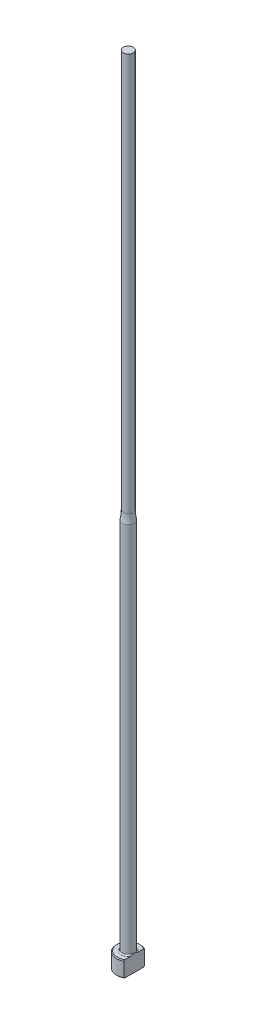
ISO-10303-21;
HEADER;
FILE_DESCRIPTION(('STEP AP214'),'2;1');
FILE_NAME('part.step','',(''),(''),'','','');
FILE_SCHEMA(('AUTOMOTIVE_DESIGN { 1 0 10303 214 1 1 1 1 }'));
ENDSEC;
DATA;
#1=APPLICATION_CONTEXT('core data for automotive mechanical design processes');
#2=APPLICATION_PROTOCOL_DEFINITION('international standard','automotive_design',2000,#1);
#3=PRODUCT_CONTEXT('',#1,'mechanical');
#4=PRODUCT('Part','Part','',(#3));
#5=PRODUCT_RELATED_PRODUCT_CATEGORY('part','',(#4));
#6=PRODUCT_DEFINITION_FORMATION('','',#4);
#7=PRODUCT_DEFINITION_CONTEXT('part definition',#1,'design');
#8=PRODUCT_DEFINITION('design','',#6,#7);
#9=PRODUCT_DEFINITION_SHAPE('','',#8);
#10=(LENGTH_UNIT() NAMED_UNIT(*) SI_UNIT(.MILLI.,.METRE.));
#11=(NAMED_UNIT(*) PLANE_ANGLE_UNIT() SI_UNIT($,.RADIAN.));
#12=(NAMED_UNIT(*) SI_UNIT($,.STERADIAN.) SOLID_ANGLE_UNIT());
#13=UNCERTAINTY_MEASURE_WITH_UNIT(LENGTH_MEASURE(1.E-05),#10,'distance_accuracy_value','');
#14=(GEOMETRIC_REPRESENTATION_CONTEXT(3) GLOBAL_UNCERTAINTY_ASSIGNED_CONTEXT((#13)) GLOBAL_UNIT_ASSIGNED_CONTEXT((#10,
#11,#12)) REPRESENTATION_CONTEXT('',''));
#15=CARTESIAN_POINT('',(0.,0.,0.));
#16=DIRECTION('',(0.,0.,1.));
#17=DIRECTION('',(1.,0.,0.));
#18=AXIS2_PLACEMENT_3D('',#15,#16,#17);
#19=CARTESIAN_POINT('',(-2.99999999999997,4.,0.));
#20=DIRECTION('',(0.,1.,0.));
#21=DIRECTION('',(0.,0.,1.));
#22=AXIS2_PLACEMENT_3D('',#19,#20,#21);
#23=PLANE('',#22);
#24=CARTESIAN_POINT('',(0.,4.,0.));
#25=DIRECTION('',(0.,1.,0.));
#26=DIRECTION('',(0.,0.,1.));
#27=AXIS2_PLACEMENT_3D('',#24,#25,#26);
#28=CIRCLE('',#27,2.79999999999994);
#29=CARTESIAN_POINT('',(1.49999999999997,4.,-2.36431808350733));
#30=VERTEX_POINT('',#29);
#31=CARTESIAN_POINT('',(1.49999999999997,4.,2.36431808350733));
#32=VERTEX_POINT('',#31);
#33=EDGE_CURVE('E187',#30,#32,#28,.T.);
#34=ORIENTED_EDGE('',*,*,#33,.T.);
#35=DIRECTION('',(0.,0.,-1.));
#36=VECTOR('',#35,1.);
#37=CARTESIAN_POINT('',(1.49999999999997,4.,0.));
#38=LINE('',#37,#36);
#39=CARTESIAN_POINT('',(1.49999999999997,4.00000000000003,0.994987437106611));
#40=VERTEX_POINT('',#39);
#41=EDGE_CURVE('E57',#32,#40,#38,.T.);
#42=ORIENTED_EDGE('',*,*,#41,.T.);
#43=CARTESIAN_POINT('',(0.,4.,0.));
#44=DIRECTION('',(0.,1.,0.));
#45=DIRECTION('',(0.,0.,1.));
#46=AXIS2_PLACEMENT_3D('',#43,#44,#45);
#47=CIRCLE('',#46,1.79999999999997);
#48=CARTESIAN_POINT('',(1.49999999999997,4.00000000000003,-0.994987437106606));
#49=VERTEX_POINT('',#48);
#50=EDGE_CURVE('E108',#40,#49,#47,.F.);
#51=ORIENTED_EDGE('',*,*,#50,.T.);
#52=EDGE_CURVE('E137',#49,#30,#38,.T.);
#53=ORIENTED_EDGE('',*,*,#52,.T.);
#54=EDGE_LOOP('',(#34,#42,#51,#53));
#55=FACE_BOUND('',#54,.T.);
#56=ADVANCED_FACE('F32',(#55),#23,.T.);
#57=CARTESIAN_POINT('',(0.,259.958771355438,0.));
#58=DIRECTION('',(0.,1.,0.));
#59=DIRECTION('',(0.,0.,1.));
#60=AXIS2_PLACEMENT_3D('',#57,#58,#59);
#61=CYLINDRICAL_SURFACE('',#60,2.99999999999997);
#62=CARTESIAN_POINT('',(0.,3.79999999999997,0.));
#63=DIRECTION('',(0.,1.,0.));
#64=DIRECTION('',(0.,0.,1.));
#65=AXIS2_PLACEMENT_3D('',#62,#63,#64);
#66=CIRCLE('',#65,2.99999999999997);
#67=CARTESIAN_POINT('',(1.49999999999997,3.79999999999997,2.5980762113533));
#68=VERTEX_POINT('',#67);
#69=CARTESIAN_POINT('',(1.49999999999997,3.79999999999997,-2.5980762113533));
#70=VERTEX_POINT('',#69);
#71=EDGE_CURVE('E105',#68,#70,#66,.F.);
#72=ORIENTED_EDGE('',*,*,#71,.T.);
#73=DIRECTION('',(0.,-1.,0.));
#74=VECTOR('',#73,1.);
#75=CARTESIAN_POINT('',(1.49999999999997,200.,-2.5980762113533));
#76=LINE('',#75,#74);
#77=CARTESIAN_POINT('',(1.49999999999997,0.200000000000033,-2.5980762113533));
#78=VERTEX_POINT('',#77);
#79=EDGE_CURVE('E193',#70,#78,#76,.T.);
#80=ORIENTED_EDGE('',*,*,#79,.T.);
#81=CARTESIAN_POINT('',(0.,0.200000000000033,0.));
#82=DIRECTION('',(0.,-1.,0.));
#83=DIRECTION('',(0.,0.,-1.));
#84=AXIS2_PLACEMENT_3D('',#81,#82,#83);
#85=CIRCLE('',#84,2.99999999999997);
#86=CARTESIAN_POINT('',(1.49999999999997,0.200000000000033,2.5980762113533));
#87=VERTEX_POINT('',#86);
#88=EDGE_CURVE('E100',#78,#87,#85,.F.);
#89=ORIENTED_EDGE('',*,*,#88,.T.);
#90=DIRECTION('',(0.,-1.,0.));
#91=VECTOR('',#90,1.);
#92=CARTESIAN_POINT('',(1.49999999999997,200.,2.5980762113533));
#93=LINE('',#92,#91);
#94=EDGE_CURVE('E93',#68,#87,#93,.T.);
#95=ORIENTED_EDGE('',*,*,#94,.F.);
#96=EDGE_LOOP('',(#72,#80,#89,#95));
#97=FACE_BOUND('',#96,.T.);
#98=ADVANCED_FACE('F158',(#97),#61,.T.);
#99=CARTESIAN_POINT('',(0.,0.,0.));
#100=DIRECTION('',(0.,-1.,0.));
#101=DIRECTION('',(0.,0.,-1.));
#102=AXIS2_PLACEMENT_3D('',#99,#100,#101);
#103=PLANE('',#102);
#104=CARTESIAN_POINT('',(0.,0.,0.));
#105=DIRECTION('',(0.,-1.,0.));
#106=DIRECTION('',(0.,0.,-1.));
#107=AXIS2_PLACEMENT_3D('',#104,#105,#106);
#108=CIRCLE('',#107,2.79999999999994);
#109=CARTESIAN_POINT('',(1.49999999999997,0.,2.36431808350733));
#110=VERTEX_POINT('',#109);
#111=CARTESIAN_POINT('',(1.49999999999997,0.,-2.36431808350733));
#112=VERTEX_POINT('',#111);
#113=EDGE_CURVE('E98',#110,#112,#108,.T.);
#114=ORIENTED_EDGE('',*,*,#113,.T.);
#115=DIRECTION('',(0.,0.,1.));
#116=VECTOR('',#115,1.);
#117=CARTESIAN_POINT('',(1.49999999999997,0.,2.5980762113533));
#118=LINE('',#117,#116);
#119=EDGE_CURVE('E83',#112,#110,#118,.T.);
#120=ORIENTED_EDGE('',*,*,#119,.T.);
#121=EDGE_LOOP('',(#114,#120));
#122=FACE_BOUND('',#121,.T.);
#123=ADVANCED_FACE('F103',(#122),#103,.T.);
#124=CARTESIAN_POINT('',(0.,4.,0.));
#125=DIRECTION('',(0.,-1.,0.));
#126=DIRECTION('',(0.,0.,-1.));
#127=AXIS2_PLACEMENT_3D('',#124,#125,#126);
#128=CONICAL_SURFACE('',#127,2.79999999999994,0.785398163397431);
#129=ORIENTED_EDGE('',*,*,#71,.F.);
#130=CARTESIAN_POINT('',(1.49999999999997,0.888258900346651,5.71827621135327));
#131=CARTESIAN_POINT('',(1.49999999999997,1.01361833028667,5.58866816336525));
#132=CARTESIAN_POINT('',(1.49999999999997,1.13884324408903,5.45892957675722));
#133=CARTESIAN_POINT('',(1.49999999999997,1.38894444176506,5.19911365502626));
#134=CARTESIAN_POINT('',(1.49999999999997,1.51382072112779,5.06903631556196));
#135=CARTESIAN_POINT('',(1.49999999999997,1.76320568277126,4.80840180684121));
#136=CARTESIAN_POINT('',(1.49999999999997,1.88771414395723,4.67784442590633));
#137=CARTESIAN_POINT('',(1.49999999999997,2.13618059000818,4.4162081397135));
#138=CARTESIAN_POINT('',(1.49999999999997,2.26013857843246,4.28512923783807));
#139=CARTESIAN_POINT('',(1.49999999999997,2.50488975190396,4.02490837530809));
#140=CARTESIAN_POINT('',(1.49999999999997,2.62569693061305,3.8957795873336));
#141=CARTESIAN_POINT('',(1.49999999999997,2.86640694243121,3.63668213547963));
#142=CARTESIAN_POINT('',(1.49999999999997,2.98630978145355,3.50671347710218));
#143=CARTESIAN_POINT('',(1.49999999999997,3.22486033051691,3.24567921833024));
#144=CARTESIAN_POINT('',(1.49999999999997,3.3435083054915,3.11461386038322));
#145=CARTESIAN_POINT('',(1.49999999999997,3.5790771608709,2.85094268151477));
#146=CARTESIAN_POINT('',(1.49999999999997,3.69599811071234,2.71833692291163));
#147=CARTESIAN_POINT('',(1.49999999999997,3.88262371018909,2.50255231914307));
#148=CARTESIAN_POINT('',(1.49999999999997,3.95312454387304,2.42006293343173));
#149=CARTESIAN_POINT('',(1.49999999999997,4.09287098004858,2.254010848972));
#150=CARTESIAN_POINT('',(1.49999999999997,4.16211645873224,2.17044804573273));
#151=CARTESIAN_POINT('',(1.49999999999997,4.29964684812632,2.00105967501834));
#152=CARTESIAN_POINT('',(1.49999999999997,4.36791386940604,1.9152195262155));
#153=CARTESIAN_POINT('',(1.49999999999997,4.50205840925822,1.7417139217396));
#154=CARTESIAN_POINT('',(1.49999999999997,4.56793649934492,1.65404891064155));
#155=CARTESIAN_POINT('',(1.49999999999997,4.69728151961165,1.47490236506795));
#156=CARTESIAN_POINT('',(1.49999999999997,4.76069661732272,1.38338308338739));
#157=CARTESIAN_POINT('',(1.49999999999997,4.88239539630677,1.19675661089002));
#158=CARTESIAN_POINT('',(1.49999999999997,4.94067201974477,1.10164473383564));
#159=CARTESIAN_POINT('',(1.49999999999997,5.048413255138,0.908008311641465));
#160=CARTESIAN_POINT('',(1.49999999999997,5.09797809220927,0.809540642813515));
#161=CARTESIAN_POINT('',(1.49999999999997,5.18432188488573,0.607192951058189));
#162=CARTESIAN_POINT('',(1.49999999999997,5.22114374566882,0.50333247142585));
#163=CARTESIAN_POINT('',(1.49999999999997,5.26099935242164,0.347577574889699));
#164=CARTESIAN_POINT('',(1.49999999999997,5.2715702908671,0.297609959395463));
#165=CARTESIAN_POINT('',(1.49999999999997,5.28794860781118,0.196885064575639));
#166=CARTESIAN_POINT('',(1.49999999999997,5.29375640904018,0.146127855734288));
#167=CARTESIAN_POINT('',(1.49999999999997,5.30019707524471,0.0444388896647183));
#168=CARTESIAN_POINT('',(1.49999999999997,5.30084594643,-0.00649183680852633));
#169=CARTESIAN_POINT('',(1.49999999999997,5.29696416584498,-0.108155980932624));
#170=CARTESIAN_POINT('',(1.49999999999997,5.29243308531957,-0.158889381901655));
#171=CARTESIAN_POINT('',(1.49999999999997,5.27856915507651,-0.259234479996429));
#172=CARTESIAN_POINT('',(1.49999999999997,5.2692782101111,-0.308852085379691));
#173=CARTESIAN_POINT('',(1.49999999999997,5.24647108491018,-0.407110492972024));
#174=CARTESIAN_POINT('',(1.49999999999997,5.23295324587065,-0.45575090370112));
#175=CARTESIAN_POINT('',(1.49999999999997,5.20226175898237,-0.55214996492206));
#176=CARTESIAN_POINT('',(1.49999999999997,5.18506801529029,-0.599902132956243));
#177=CARTESIAN_POINT('',(1.49999999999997,5.1477138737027,-0.694205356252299));
#178=CARTESIAN_POINT('',(1.49999999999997,5.12755408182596,-0.740756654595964));
#179=CARTESIAN_POINT('',(1.49999999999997,5.0632769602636,-0.879166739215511));
#180=CARTESIAN_POINT('',(1.49999999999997,5.01551721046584,-0.969329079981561));
#181=CARTESIAN_POINT('',(1.49999999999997,4.91367909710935,-1.14604316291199));
#182=CARTESIAN_POINT('',(1.49999999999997,4.85959300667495,-1.2325903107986));
#183=CARTESIAN_POINT('',(1.49999999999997,4.74697968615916,-1.40321348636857));
#184=CARTESIAN_POINT('',(1.49999999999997,4.68843573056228,-1.4872783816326));
#185=CARTESIAN_POINT('',(1.49999999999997,4.5684384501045,-1.65322187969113));
#186=CARTESIAN_POINT('',(1.49999999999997,4.50698656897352,-1.73510153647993));
#187=CARTESIAN_POINT('',(1.49999999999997,4.3811567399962,-1.89829823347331));
#188=CARTESIAN_POINT('',(1.49999999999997,4.31675092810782,-1.97959369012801));
#189=CARTESIAN_POINT('',(1.49999999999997,4.18634068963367,-2.14090082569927));
#190=CARTESIAN_POINT('',(1.49999999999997,4.12033609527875,-2.22091236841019));
#191=CARTESIAN_POINT('',(1.49999999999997,3.92086431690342,-2.45906508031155));
#192=CARTESIAN_POINT('',(1.49999999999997,3.78562663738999,-2.61572090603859));
#193=CARTESIAN_POINT('',(1.49999999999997,3.53554498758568,-2.90006295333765));
#194=CARTESIAN_POINT('',(1.49999999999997,3.42114543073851,-3.02814382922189));
#195=CARTESIAN_POINT('',(1.49999999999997,3.1909355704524,-3.28303767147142));
#196=CARTESIAN_POINT('',(1.49999999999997,3.07512522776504,-3.40985060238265));
#197=CARTESIAN_POINT('',(1.49999999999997,2.72597067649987,-3.78913849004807));
#198=CARTESIAN_POINT('',(1.49999999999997,2.49111760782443,-4.04022177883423));
#199=CARTESIAN_POINT('',(1.49999999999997,2.0288247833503,-4.52992803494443));
#200=CARTESIAN_POINT('',(1.49999999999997,1.80147747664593,-4.7686387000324));
#201=CARTESIAN_POINT('',(1.49999999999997,1.45954865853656,-5.12558036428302));
#202=CARTESIAN_POINT('',(1.49999999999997,1.34548484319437,-5.24430773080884));
#203=CARTESIAN_POINT('',(1.49999999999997,1.11707176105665,-5.48148573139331));
#204=CARTESIAN_POINT('',(1.49999999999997,1.00272249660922,-5.59993636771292));
#205=CARTESIAN_POINT('',(1.49999999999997,0.888258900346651,-5.71827621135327));
#206=B_SPLINE_CURVE_WITH_KNOTS('',3,(#130,#131,#132,#133,#134,#135,#136,#137,#138,#139,#140,
#141,#142,#143,#144,#145,#146,#147,#148,#149,#150,#151,#152,#153,#154,#155,#156,#157,#158,#159,
#160,#161,#162,#163,#164,#165,#166,#167,#168,#169,#170,#171,#172,#173,#174,#175,#176,#177,#178,
#179,#180,#181,#182,#183,#184,#185,#186,#187,#188,#189,#190,#191,#192,#193,#194,#195,#196,#197,
#198,#199,#200,#201,#202,#203,#204,#205),.UNSPECIFIED.,.F.,.F.,(4,2,2,2,2,2,2,2,2,2,2,2,2,2,2,2,
2,2,2,2,2,2,2,2,2,2,2,2,2,2,2,2,2,2,2,2,2,4),(0.,0.540943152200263,1.08189327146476,
1.62312052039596,2.16434426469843,2.69482920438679,3.22531067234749,3.75567781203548,
4.28602356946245,4.611550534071,4.9371094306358,5.26610945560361,5.59503024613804,
5.92894782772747,6.26331713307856,6.59354403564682,6.92264800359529,7.07567478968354,
7.22868799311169,7.38122626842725,7.53377717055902,7.68500755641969,7.83629736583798,
7.988436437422,8.14054446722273,8.44618799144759,8.75220879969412,9.05944044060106,
9.36652111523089,9.6776428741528,9.98879742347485,10.609592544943,11.1247803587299,
11.6399825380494,12.6713544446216,13.6603005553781,14.1542238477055,14.6481430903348),.UNSPECIFIED.);
#207=EDGE_CURVE('E136',#68,#32,#206,.T.);
#208=ORIENTED_EDGE('',*,*,#207,.T.);
#209=ORIENTED_EDGE('',*,*,#33,.F.);
#210=EDGE_CURVE('E128',#30,#70,#206,.T.);
#211=ORIENTED_EDGE('',*,*,#210,.T.);
#212=EDGE_LOOP('',(#129,#208,#209,#211));
#213=FACE_BOUND('',#212,.T.);
#214=ADVANCED_FACE('F144',(#213),#128,.T.);
#215=CARTESIAN_POINT('',(0.,0.200000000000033,0.));
#216=DIRECTION('',(0.,1.,0.));
#217=DIRECTION('',(0.,0.,1.));
#218=AXIS2_PLACEMENT_3D('',#215,#216,#217);
#219=CONICAL_SURFACE('',#218,2.99999999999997,0.785398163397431);
#220=ORIENTED_EDGE('',*,*,#88,.F.);
#221=CARTESIAN_POINT('',(1.49999999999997,3.11174109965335,-5.71827621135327));
#222=CARTESIAN_POINT('',(1.49999999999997,2.98638166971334,-5.58866816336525));
#223=CARTESIAN_POINT('',(1.49999999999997,2.86115675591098,-5.45892957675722));
#224=CARTESIAN_POINT('',(1.49999999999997,2.61105555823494,-5.19911365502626));
#225=CARTESIAN_POINT('',(1.49999999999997,2.48617927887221,-5.06903631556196));
#226=CARTESIAN_POINT('',(1.49999999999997,2.23679431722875,-4.80840180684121));
#227=CARTESIAN_POINT('',(1.49999999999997,2.11228585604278,-4.67784442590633));
#228=CARTESIAN_POINT('',(1.49999999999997,1.86381940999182,-4.4162081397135));
#229=CARTESIAN_POINT('',(1.49999999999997,1.73986142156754,-4.28512923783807));
#230=CARTESIAN_POINT('',(1.49999999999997,1.49511024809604,-4.02490837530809));
#231=CARTESIAN_POINT('',(1.49999999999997,1.37430306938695,-3.8957795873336));
#232=CARTESIAN_POINT('',(1.49999999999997,1.13359305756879,-3.63668213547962));
#233=CARTESIAN_POINT('',(1.49999999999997,1.01369021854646,-3.50671347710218));
#234=CARTESIAN_POINT('',(1.49999999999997,0.775139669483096,-3.24567921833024));
#235=CARTESIAN_POINT('',(1.49999999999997,0.656491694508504,-3.11461386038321));
#236=CARTESIAN_POINT('',(1.49999999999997,0.420922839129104,-2.85094268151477));
#237=CARTESIAN_POINT('',(1.49999999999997,0.304001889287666,-2.71833692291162));
#238=CARTESIAN_POINT('',(1.49999999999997,0.117376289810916,-2.50255231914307));
#239=CARTESIAN_POINT('',(1.49999999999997,0.0468754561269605,-2.42006293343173));
#240=CARTESIAN_POINT('',(1.49999999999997,-0.0928709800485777,-2.254010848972));
#241=CARTESIAN_POINT('',(1.49999999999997,-0.162116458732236,-2.17044804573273));
#242=CARTESIAN_POINT('',(1.49999999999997,-0.299646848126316,-2.00105967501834));
#243=CARTESIAN_POINT('',(1.49999999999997,-0.367913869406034,-1.9152195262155));
#244=CARTESIAN_POINT('',(1.49999999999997,-0.502058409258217,-1.7417139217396));
#245=CARTESIAN_POINT('',(1.49999999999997,-0.567936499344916,-1.65404891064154));
#246=CARTESIAN_POINT('',(1.49999999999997,-0.697281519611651,-1.47490236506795));
#247=CARTESIAN_POINT('',(1.49999999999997,-0.760696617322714,-1.38338308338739));
#248=CARTESIAN_POINT('',(1.49999999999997,-0.882395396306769,-1.19675661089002));
#249=CARTESIAN_POINT('',(1.49999999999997,-0.940672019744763,-1.10164473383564));
#250=CARTESIAN_POINT('',(1.49999999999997,-1.048413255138,-0.908008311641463));
#251=CARTESIAN_POINT('',(1.49999999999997,-1.09797809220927,-0.809540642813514));
#252=CARTESIAN_POINT('',(1.49999999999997,-1.18432188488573,-0.607192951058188));
#253=CARTESIAN_POINT('',(1.49999999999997,-1.22114374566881,-0.503332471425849));
#254=CARTESIAN_POINT('',(1.49999999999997,-1.26099935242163,-0.347577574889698));
#255=CARTESIAN_POINT('',(1.49999999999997,-1.2715702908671,-0.297609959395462));
#256=CARTESIAN_POINT('',(1.49999999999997,-1.28794860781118,-0.196885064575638));
#257=CARTESIAN_POINT('',(1.49999999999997,-1.29375640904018,-0.146127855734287));
#258=CARTESIAN_POINT('',(1.49999999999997,-1.30019707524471,-0.0444388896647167));
#259=CARTESIAN_POINT('',(1.49999999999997,-1.30084594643,0.00649183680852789));
#260=CARTESIAN_POINT('',(1.49999999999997,-1.29696416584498,0.108155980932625));
#261=CARTESIAN_POINT('',(1.49999999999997,-1.29243308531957,0.158889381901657));
#262=CARTESIAN_POINT('',(1.49999999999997,-1.2785691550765,0.259234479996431));
#263=CARTESIAN_POINT('',(1.49999999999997,-1.2692782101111,0.308852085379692));
#264=CARTESIAN_POINT('',(1.49999999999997,-1.24647108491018,0.407110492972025));
#265=CARTESIAN_POINT('',(1.49999999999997,-1.23295324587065,0.455750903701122));
#266=CARTESIAN_POINT('',(1.49999999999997,-1.20226175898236,0.552149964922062));
#267=CARTESIAN_POINT('',(1.49999999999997,-1.18506801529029,0.599902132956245));
#268=CARTESIAN_POINT('',(1.49999999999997,-1.14771387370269,0.694205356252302));
#269=CARTESIAN_POINT('',(1.49999999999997,-1.12755408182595,0.740756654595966));
#270=CARTESIAN_POINT('',(1.49999999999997,-1.0632769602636,0.879166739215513));
#271=CARTESIAN_POINT('',(1.49999999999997,-1.01551721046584,0.969329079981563));
#272=CARTESIAN_POINT('',(1.49999999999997,-0.913679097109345,1.14604316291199));
#273=CARTESIAN_POINT('',(1.49999999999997,-0.859593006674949,1.2325903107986));
#274=CARTESIAN_POINT('',(1.49999999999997,-0.746979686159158,1.40321348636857));
#275=CARTESIAN_POINT('',(1.49999999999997,-0.688435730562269,1.4872783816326));
#276=CARTESIAN_POINT('',(1.49999999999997,-0.568438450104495,1.65322187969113));
#277=CARTESIAN_POINT('',(1.49999999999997,-0.506986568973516,1.73510153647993));
#278=CARTESIAN_POINT('',(1.49999999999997,-0.381156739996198,1.89829823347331));
#279=CARTESIAN_POINT('',(1.49999999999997,-0.316750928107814,1.97959369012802));
#280=CARTESIAN_POINT('',(1.49999999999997,-0.186340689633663,2.14090082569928));
#281=CARTESIAN_POINT('',(1.49999999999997,-0.12033609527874,2.22091236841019));
#282=CARTESIAN_POINT('',(1.49999999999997,0.0791356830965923,2.45906508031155));
#283=CARTESIAN_POINT('',(1.49999999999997,0.214373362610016,2.61572090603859));
#284=CARTESIAN_POINT('',(1.49999999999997,0.46445501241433,2.90006295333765));
#285=CARTESIAN_POINT('',(1.49999999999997,0.578854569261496,3.02814382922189));
#286=CARTESIAN_POINT('',(1.49999999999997,0.809064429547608,3.28303767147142));
#287=CARTESIAN_POINT('',(1.49999999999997,0.924874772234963,3.40985060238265));
#288=CARTESIAN_POINT('',(1.49999999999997,1.27402932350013,3.78913849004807));
#289=CARTESIAN_POINT('',(1.49999999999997,1.50888239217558,4.04022177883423));
#290=CARTESIAN_POINT('',(1.49999999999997,1.97117521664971,4.52992803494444));
#291=CARTESIAN_POINT('',(1.49999999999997,2.19852252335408,4.76863870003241));
#292=CARTESIAN_POINT('',(1.49999999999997,2.54045134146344,5.12558036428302));
#293=CARTESIAN_POINT('',(1.49999999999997,2.65451515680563,5.24430773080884));
#294=CARTESIAN_POINT('',(1.49999999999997,2.88292823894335,5.48148573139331));
#295=CARTESIAN_POINT('',(1.49999999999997,2.99727750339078,5.59993636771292));
#296=CARTESIAN_POINT('',(1.49999999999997,3.11174109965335,5.71827621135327));
#297=B_SPLINE_CURVE_WITH_KNOTS('',3,(#221,#222,#223,#224,#225,#226,#227,#228,#229,#230,#231,
#232,#233,#234,#235,#236,#237,#238,#239,#240,#241,#242,#243,#244,#245,#246,#247,#248,#249,#250,
#251,#252,#253,#254,#255,#256,#257,#258,#259,#260,#261,#262,#263,#264,#265,#266,#267,#268,#269,
#270,#271,#272,#273,#274,#275,#276,#277,#278,#279,#280,#281,#282,#283,#284,#285,#286,#287,#288,
#289,#290,#291,#292,#293,#294,#295,#296),.UNSPECIFIED.,.F.,.F.,(4,2,2,2,2,2,2,2,2,2,2,2,2,2,2,2,
2,2,2,2,2,2,2,2,2,2,2,2,2,2,2,2,2,2,2,2,2,4),(0.,0.540943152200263,1.08189327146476,
1.62312052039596,2.16434426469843,2.69482920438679,3.22531067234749,3.75567781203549,
4.28602356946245,4.611550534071,4.9371094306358,5.26610945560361,5.59503024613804,
5.92894782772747,6.26331713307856,6.59354403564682,6.92264800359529,7.07567478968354,
7.2286879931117,7.38122626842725,7.53377717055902,7.6850075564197,7.83629736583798,
7.98843643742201,8.14054446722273,8.44618799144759,8.75220879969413,9.05944044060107,
9.3665211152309,9.6776428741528,9.98879742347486,10.609592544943,11.1247803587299,
11.6399825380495,12.6713544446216,13.6603005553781,14.1542238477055,14.6481430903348),.UNSPECIFIED.);
#298=EDGE_CURVE('E86',#78,#112,#297,.T.);
#299=ORIENTED_EDGE('',*,*,#298,.T.);
#300=ORIENTED_EDGE('',*,*,#113,.F.);
#301=EDGE_CURVE('E89',#110,#87,#297,.T.);
#302=ORIENTED_EDGE('',*,*,#301,.T.);
#303=EDGE_LOOP('',(#220,#299,#300,#302));
#304=FACE_BOUND('',#303,.T.);
#305=ADVANCED_FACE('F97',(#304),#219,.T.);
#306=CARTESIAN_POINT('',(0.,4.30000000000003,0.));
#307=DIRECTION('',(0.,1.,0.));
#308=DIRECTION('',(0.,0.,1.));
#309=AXIS2_PLACEMENT_3D('',#306,#307,#308);
#310=TOROIDAL_SURFACE('',#309,1.79999999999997,0.3);
#311=CARTESIAN_POINT('',(1.49999999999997,4.30000000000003,0.));
#312=CARTESIAN_POINT('',(1.49999999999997,4.30000063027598,3.41945444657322E-12));
#313=CARTESIAN_POINT('',(1.49999999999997,4.30000126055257,-1.15373636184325E-07));
#314=CARTESIAN_POINT('',(1.49999999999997,4.30000248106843,-4.90631569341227E-07));
#315=CARTESIAN_POINT('',(1.49999999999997,4.30000307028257,-7.53296664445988E-07));
#316=CARTESIAN_POINT('',(1.49999999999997,4.30000424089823,-1.38757095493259E-06));
#317=CARTESIAN_POINT('',(1.49999999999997,4.30000481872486,-1.76563000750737E-06));
#318=CARTESIAN_POINT('',(1.49999999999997,4.30000591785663,-2.58768006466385E-06));
#319=CARTESIAN_POINT('',(1.49999999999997,4.30000643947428,-3.03127013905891E-06));
#320=CARTESIAN_POINT('',(1.49999999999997,4.30000815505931,-4.60021967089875E-06));
#321=CARTESIAN_POINT('',(1.49999999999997,4.30000927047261,-5.81241520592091E-06));
#322=CARTESIAN_POINT('',(1.49999999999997,4.30001128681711,-8.33989414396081E-06));
#323=CARTESIAN_POINT('',(1.49999999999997,4.30001219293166,-9.65128158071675E-06));
#324=CARTESIAN_POINT('',(1.49999999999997,4.30001551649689,-1.46782506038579E-05));
#325=CARTESIAN_POINT('',(1.49999999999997,4.30001775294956,-1.85179769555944E-05));
#326=CARTESIAN_POINT('',(1.49999999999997,4.30002148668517,-2.61616194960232E-05));
#327=CARTESIAN_POINT('',(1.49999999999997,4.30002302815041,-2.99447742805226E-05));
#328=CARTESIAN_POINT('',(1.49999999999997,4.30002943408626,-4.58003745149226E-05));
#329=CARTESIAN_POINT('',(1.49999999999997,4.3000341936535,-5.79079080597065E-05));
#330=CARTESIAN_POINT('',(1.49999999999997,4.30004197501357,-8.07263758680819E-05));
#331=CARTESIAN_POINT('',(1.49999999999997,4.30004514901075,-9.13834712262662E-05));
#332=CARTESIAN_POINT('',(1.49999999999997,4.30006989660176,-0.000167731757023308));
#333=CARTESIAN_POINT('',(1.49999999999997,4.30010092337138,-0.000229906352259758));
#334=CARTESIAN_POINT('',(1.49999999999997,4.30021632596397,-0.000470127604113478));
#335=CARTESIAN_POINT('',(1.49999999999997,4.30029368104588,-0.000650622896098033));
#336=CARTESIAN_POINT('',(1.49999999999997,4.30059619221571,-0.00134589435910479));
#337=CARTESIAN_POINT('',(1.49999999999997,4.30082870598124,-0.00185814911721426));
#338=CARTESIAN_POINT('',(1.49999999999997,4.30176696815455,-0.0039354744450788));
#339=CARTESIAN_POINT('',(1.49999999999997,4.30246445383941,-0.00550332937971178));
#340=CARTESIAN_POINT('',(1.49999999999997,4.31426785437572,-0.0320229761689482));
#341=CARTESIAN_POINT('',(1.49999999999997,4.3254480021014,-0.0569503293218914));
#342=CARTESIAN_POINT('',(1.49999999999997,4.34725700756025,-0.105984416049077));
#343=CARTESIAN_POINT('',(1.49999999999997,4.35789134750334,-0.130088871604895));
#344=CARTESIAN_POINT('',(1.49999999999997,4.38015321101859,-0.181096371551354));
#345=CARTESIAN_POINT('',(1.49999999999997,4.39175804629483,-0.208009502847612));
#346=CARTESIAN_POINT('',(1.49999999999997,4.41469034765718,-0.262264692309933));
#347=CARTESIAN_POINT('',(1.49999999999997,4.42601398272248,-0.289608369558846));
#348=CARTESIAN_POINT('',(1.49999999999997,4.45363212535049,-0.358203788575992));
#349=CARTESIAN_POINT('',(1.49999999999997,4.46959026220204,-0.399592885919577));
#350=CARTESIAN_POINT('',(1.49999999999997,4.49940505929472,-0.48209793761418));
#351=CARTESIAN_POINT('',(1.49999999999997,4.51330033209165,-0.523199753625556));
#352=CARTESIAN_POINT('',(1.49999999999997,4.53552507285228,-0.595497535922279));
#353=CARTESIAN_POINT('',(1.49999999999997,4.54436834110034,-0.626532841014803));
#354=CARTESIAN_POINT('',(1.49999999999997,4.56052427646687,-0.689176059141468));
#355=CARTESIAN_POINT('',(1.49999999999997,4.56782794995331,-0.720786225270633));
#356=CARTESIAN_POINT('',(1.49999999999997,4.5875075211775,-0.819524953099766));
#357=CARTESIAN_POINT('',(1.49999999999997,4.59661044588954,-0.887429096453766));
#358=CARTESIAN_POINT('',(1.49999999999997,4.60059842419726,-0.991180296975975));
#359=CARTESIAN_POINT('',(1.49999999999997,4.60019840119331,-1.02684364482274));
#360=CARTESIAN_POINT('',(1.49999999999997,4.59497085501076,-1.09750559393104));
#361=CARTESIAN_POINT('',(1.49999999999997,4.59019295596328,-1.13250716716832));
#362=CARTESIAN_POINT('',(1.49999999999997,4.57687734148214,-1.19353096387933));
#363=CARTESIAN_POINT('',(1.49999999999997,4.56943875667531,-1.21978854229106));
#364=CARTESIAN_POINT('',(1.49999999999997,4.55063748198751,-1.27094658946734));
#365=CARTESIAN_POINT('',(1.49999999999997,4.53927342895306,-1.29584658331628));
#366=CARTESIAN_POINT('',(1.49999999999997,4.51660016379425,-1.33501873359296));
#367=CARTESIAN_POINT('',(1.49999999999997,4.50657738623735,-1.35003296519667));
#368=CARTESIAN_POINT('',(1.49999999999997,4.48437469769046,-1.37837252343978));
#369=CARTESIAN_POINT('',(1.49999999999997,4.47219867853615,-1.3917008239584));
#370=CARTESIAN_POINT('',(1.49999999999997,4.4483561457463,-1.4134941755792));
#371=CARTESIAN_POINT('',(1.49999999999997,4.43709185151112,-1.42239673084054));
#372=CARTESIAN_POINT('',(1.49999999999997,4.41325256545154,-1.43825467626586));
#373=CARTESIAN_POINT('',(1.49999999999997,4.40067804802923,-1.44521076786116));
#374=CARTESIAN_POINT('',(1.49999999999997,4.37433767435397,-1.45677158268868));
#375=CARTESIAN_POINT('',(1.49999999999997,4.36056203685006,-1.46135438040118));
#376=CARTESIAN_POINT('',(1.49999999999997,4.33237324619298,-1.46767730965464));
#377=CARTESIAN_POINT('',(1.49999999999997,4.3179607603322,-1.46942034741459));
#378=CARTESIAN_POINT('',(1.49999999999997,4.29122479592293,-1.4698720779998));
#379=CARTESIAN_POINT('',(1.49999999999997,4.27890664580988,-1.468990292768));
#380=CARTESIAN_POINT('',(1.49999999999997,4.25461019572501,-1.4651157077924));
#381=CARTESIAN_POINT('',(1.49999999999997,4.24263187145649,-1.46212305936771));
#382=CARTESIAN_POINT('',(1.49999999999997,4.21959683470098,-1.4543117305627));
#383=CARTESIAN_POINT('',(1.49999999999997,4.20852542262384,-1.44953579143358));
#384=CARTESIAN_POINT('',(1.49999999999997,4.18721125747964,-1.43840957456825));
#385=CARTESIAN_POINT('',(1.49999999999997,4.17696878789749,-1.43205876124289));
#386=CARTESIAN_POINT('',(1.49999999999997,4.15325976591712,-1.41506353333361));
#387=CARTESIAN_POINT('',(1.49999999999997,4.14027750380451,-1.40374235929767));
#388=CARTESIAN_POINT('',(1.49999999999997,4.11630720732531,-1.37914825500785));
#389=CARTESIAN_POINT('',(1.49999999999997,4.10532420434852,-1.36587054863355));
#390=CARTESIAN_POINT('',(1.49999999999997,4.08100891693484,-1.33197272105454));
#391=CARTESIAN_POINT('',(1.49999999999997,4.06867625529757,-1.31063843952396));
#392=CARTESIAN_POINT('',(1.49999999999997,4.04751867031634,-1.26637455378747));
#393=CARTESIAN_POINT('',(1.49999999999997,4.03869240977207,-1.24344556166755));
#394=CARTESIAN_POINT('',(1.49999999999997,4.01978360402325,-1.18316534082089));
#395=CARTESIAN_POINT('',(1.49999999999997,4.01191472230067,-1.14512623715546));
#396=CARTESIAN_POINT('',(1.49999999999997,4.00188285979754,-1.06789971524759));
#397=CARTESIAN_POINT('',(1.49999999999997,3.99979735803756,-1.02870374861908));
#398=CARTESIAN_POINT('',(1.49999999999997,4.00021727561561,-0.953160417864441));
#399=CARTESIAN_POINT('',(1.49999999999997,4.00240673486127,-0.916808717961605));
#400=CARTESIAN_POINT('',(1.49999999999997,4.00996433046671,-0.844432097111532));
#401=CARTESIAN_POINT('',(1.49999999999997,4.01533462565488,-0.808407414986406));
#402=CARTESIAN_POINT('',(1.49999999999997,4.02828086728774,-0.738670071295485));
#403=CARTESIAN_POINT('',(1.49999999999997,4.03573028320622,-0.704933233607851));
#404=CARTESIAN_POINT('',(1.49999999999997,4.05243174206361,-0.638128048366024));
#405=CARTESIAN_POINT('',(1.49999999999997,4.06167285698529,-0.605056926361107));
#406=CARTESIAN_POINT('',(1.49999999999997,4.08440652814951,-0.530195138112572));
#407=CARTESIAN_POINT('',(1.49999999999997,4.0983657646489,-0.488547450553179));
#408=CARTESIAN_POINT('',(1.49999999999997,4.12838209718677,-0.404954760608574));
#409=CARTESIAN_POINT('',(1.49999999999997,4.14447968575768,-0.36302453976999));
#410=CARTESIAN_POINT('',(1.49999999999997,4.17238454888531,-0.293508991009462));
#411=CARTESIAN_POINT('',(1.49999999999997,4.18384249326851,-0.265781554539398));
#412=CARTESIAN_POINT('',(1.49999999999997,4.20705854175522,-0.210769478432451));
#413=CARTESIAN_POINT('',(1.49999999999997,4.21881265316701,-0.183483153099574));
#414=CARTESIAN_POINT('',(1.49999999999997,4.24136702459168,-0.131772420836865));
#415=CARTESIAN_POINT('',(1.49999999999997,4.25214361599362,-0.10733750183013));
#416=CARTESIAN_POINT('',(1.49999999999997,4.27424746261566,-0.0576321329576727));
#417=CARTESIAN_POINT('',(1.49999999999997,4.28558038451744,-0.0323640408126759));
#418=CARTESIAN_POINT('',(1.49999999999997,4.29753556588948,-0.00550327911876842));
#419=CARTESIAN_POINT('',(1.49999999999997,4.29823307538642,-0.00393537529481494));
#420=CARTESIAN_POINT('',(1.49999999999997,4.2991713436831,-0.00185803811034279));
#421=CARTESIAN_POINT('',(1.49999999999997,4.29940384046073,-0.00134582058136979));
#422=CARTESIAN_POINT('',(1.49999999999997,4.29970633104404,-0.000650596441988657));
#423=CARTESIAN_POINT('',(1.49999999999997,4.29978368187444,-0.000470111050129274));
#424=CARTESIAN_POINT('',(1.49999999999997,4.29989907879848,-0.000229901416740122));
#425=CARTESIAN_POINT('',(1.49999999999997,4.29993010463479,-0.000167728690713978));
#426=CARTESIAN_POINT('',(1.49999999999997,4.29995485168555,-9.13825695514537E-05));
#427=CARTESIAN_POINT('',(1.49999999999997,4.29995802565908,-8.07256246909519E-05));
#428=CARTESIAN_POINT('',(1.49999999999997,4.29996580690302,-5.79074825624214E-05));
#429=CARTESIAN_POINT('',(1.49999999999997,4.29997056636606,-4.58001201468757E-05));
#430=CARTESIAN_POINT('',(1.49999999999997,4.29997697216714,-2.99447122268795E-05));
#431=CARTESIAN_POINT('',(1.49999999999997,4.29997851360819,-2.61615819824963E-05));
#432=CARTESIAN_POINT('',(1.49999999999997,4.29998224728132,-1.85179847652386E-05));
#433=CARTESIAN_POINT('',(1.49999999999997,4.29998448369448,-1.46782784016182E-05));
#434=CARTESIAN_POINT('',(1.49999999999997,4.29998780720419,-9.65132765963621E-06));
#435=CARTESIAN_POINT('',(1.49999999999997,4.29998871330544,-8.33994215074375E-06));
#436=CARTESIAN_POINT('',(1.49999999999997,4.29999072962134,-5.81246437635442E-06));
#437=CARTESIAN_POINT('',(1.49999999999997,4.29999184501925,-4.60026797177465E-06));
#438=CARTESIAN_POINT('',(1.49999999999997,4.29999356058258,-3.03131401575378E-06));
#439=CARTESIAN_POINT('',(1.49999999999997,4.29999408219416,-2.5877220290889E-06));
#440=CARTESIAN_POINT('',(1.49999999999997,4.29999518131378,-1.76566706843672E-06));
#441=CARTESIAN_POINT('',(1.49999999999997,4.29999575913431,-1.38760501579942E-06));
#442=CARTESIAN_POINT('',(1.49999999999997,4.29999692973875,-7.53323456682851E-07));
#443=CARTESIAN_POINT('',(1.49999999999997,4.29999751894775,-4.9065421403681E-07));
#444=CARTESIAN_POINT('',(1.49999999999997,4.2999987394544,-1.15386277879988E-07));
#445=CARTESIAN_POINT('',(1.49999999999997,4.2999993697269,-3.41943909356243E-12));
#446=CARTESIAN_POINT('',(1.49999999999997,4.30000000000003,0.));
#447=B_SPLINE_CURVE_WITH_KNOTS('',3,(#311,#312,#313,#314,#315,#316,#317,#318,#319,#320,#321,
#322,#323,#324,#325,#326,#327,#328,#329,#330,#331,#332,#333,#334,#335,#336,#337,#338,#339,#340,
#341,#342,#343,#344,#345,#346,#347,#348,#349,#350,#351,#352,#353,#354,#355,#356,#357,#358,#359,
#360,#361,#362,#363,#364,#365,#366,#367,#368,#369,#370,#371,#372,#373,#374,#375,#376,#377,#378,
#379,#380,#381,#382,#383,#384,#385,#386,#387,#388,#389,#390,#391,#392,#393,#394,#395,#396,#397,
#398,#399,#400,#401,#402,#403,#404,#405,#406,#407,#408,#409,#410,#411,#412,#413,#414,#415,#416,
#417,#418,#419,#420,#421,#422,#423,#424,#425,#426,#427,#428,#429,#430,#431,#432,#433,#434,#435,
#436,#437,#438,#439,#440,#441,#442,#443,#444,#445,#446),.UNSPECIFIED.,.T.,.F.,(4,2,2,2,2,2,2,2,
2,2,2,2,2,2,2,2,2,2,2,2,2,2,2,2,2,2,2,2,2,2,2,2,2,2,2,2,2,2,2,2,2,2,2,2,2,2,2,2,2,2,2,2,2,2,2,2,
2,2,2,2,2,2,2,2,2,2,2,4),(0.,1.88906030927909E-06,3.81509580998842E-06,5.87892822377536E-06,
7.93062004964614E-06,1.28480887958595E-05,1.76261714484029E-05,3.0909918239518E-05,
4.31529746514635E-05,8.2169932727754E-05,0.000115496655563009,0.000323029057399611,
0.000912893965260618,0.00259963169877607,0.00774858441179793,0.0896975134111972,
0.168737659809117,0.256660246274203,0.345444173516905,0.478492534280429,0.60860395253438,
0.705372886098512,0.802692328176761,1.00719557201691,1.11399616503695,1.21960092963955,
1.30124317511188,1.38291380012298,1.43690814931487,1.49080588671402,1.53371524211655,
1.57660911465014,1.61989249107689,1.66313154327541,1.69999492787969,1.73685567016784,
1.77288440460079,1.80892540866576,1.86031324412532,1.91182866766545,1.98534297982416,
2.05882922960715,2.17471722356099,2.29215041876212,2.40123170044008,2.51038710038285,
2.61397263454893,2.71694519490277,2.84866234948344,2.98337525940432,3.07337666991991,
3.16250453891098,3.24262397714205,3.3256930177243,3.33084213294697,3.33252874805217,
3.33311858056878,3.33332610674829,3.33335943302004,3.33339844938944,3.3334106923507,
3.3334239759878,3.33342875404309,3.33343367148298,3.33343572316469,3.33343778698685,
3.33343971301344,3.33344160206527),.UNSPECIFIED.);
#448=CARTESIAN_POINT('',(1.49999999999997,4.30000000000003,0.));
#449=VERTEX_POINT('',#448);
#450=EDGE_CURVE('E11',#49,#449,#447,.T.);
#451=ORIENTED_EDGE('',*,*,#450,.F.);
#452=ORIENTED_EDGE('',*,*,#50,.F.);
#453=CARTESIAN_POINT('',(1.49999999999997,4.30000000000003,0.));
#454=CARTESIAN_POINT('',(1.49999999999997,4.29999936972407,-3.4196040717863E-12));
#455=CARTESIAN_POINT('',(1.49999999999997,4.29999873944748,1.15373635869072E-07));
#456=CARTESIAN_POINT('',(1.49999999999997,4.29999751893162,4.90631569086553E-07));
#457=CARTESIAN_POINT('',(1.49999999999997,4.29999692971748,7.53296664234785E-07));
#458=CARTESIAN_POINT('',(1.49999999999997,4.29999575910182,1.38757095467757E-06));
#459=CARTESIAN_POINT('',(1.49999999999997,4.2999951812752,1.76563000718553E-06));
#460=CARTESIAN_POINT('',(1.49999999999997,4.29999408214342,2.58768006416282E-06));
#461=CARTESIAN_POINT('',(1.49999999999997,4.29999356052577,3.03127013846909E-06));
#462=CARTESIAN_POINT('',(1.49999999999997,4.29999184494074,4.60021967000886E-06));
#463=CARTESIAN_POINT('',(1.49999999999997,4.29999072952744,5.81241520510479E-06));
#464=CARTESIAN_POINT('',(1.49999999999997,4.29998871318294,8.33989414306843E-06));
#465=CARTESIAN_POINT('',(1.49999999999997,4.29998780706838,9.65128157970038E-06));
#466=CARTESIAN_POINT('',(1.49999999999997,4.29998448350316,1.46782506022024E-05));
#467=CARTESIAN_POINT('',(1.49999999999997,4.29998224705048,1.85179769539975E-05));
#468=CARTESIAN_POINT('',(1.49999999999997,4.29997851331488,2.61616194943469E-05));
#469=CARTESIAN_POINT('',(1.49999999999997,4.29997697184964,2.99447742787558E-05));
#470=CARTESIAN_POINT('',(1.49999999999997,4.29997056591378,4.58003745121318E-05));
#471=CARTESIAN_POINT('',(1.49999999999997,4.29996580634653,5.7907908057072E-05));
#472=CARTESIAN_POINT('',(1.49999999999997,4.29995802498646,8.07263758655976E-05));
#473=CARTESIAN_POINT('',(1.49999999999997,4.29995485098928,9.13834712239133E-05));
#474=CARTESIAN_POINT('',(1.49999999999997,4.29993010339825,0.000167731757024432));
#475=CARTESIAN_POINT('',(1.49999999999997,4.29989907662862,0.000229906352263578));
#476=CARTESIAN_POINT('',(1.49999999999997,4.29978367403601,0.000470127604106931));
#477=CARTESIAN_POINT('',(1.49999999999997,4.29970631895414,0.000650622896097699));
#478=CARTESIAN_POINT('',(1.49999999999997,4.2994038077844,0.00134589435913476));
#479=CARTESIAN_POINT('',(1.49999999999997,4.29917129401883,0.00185814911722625));
#480=CARTESIAN_POINT('',(1.49999999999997,4.29823303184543,0.00393547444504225));
#481=CARTESIAN_POINT('',(1.49999999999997,4.29753554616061,0.00550332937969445));
#482=CARTESIAN_POINT('',(1.49999999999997,4.28573214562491,0.0320229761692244));
#483=CARTESIAN_POINT('',(1.49999999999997,4.2745519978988,0.0569503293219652));
#484=CARTESIAN_POINT('',(1.49999999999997,4.25274299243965,0.105984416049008));
#485=CARTESIAN_POINT('',(1.49999999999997,4.24210865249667,0.130088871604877));
#486=CARTESIAN_POINT('',(1.49999999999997,4.21984678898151,0.181096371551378));
#487=CARTESIAN_POINT('',(1.49999999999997,4.20824195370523,0.208009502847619));
#488=CARTESIAN_POINT('',(1.49999999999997,4.18530965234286,0.262264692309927));
#489=CARTESIAN_POINT('',(1.49999999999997,4.17398601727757,0.289608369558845));
#490=CARTESIAN_POINT('',(1.49999999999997,4.14636787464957,0.358203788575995));
#491=CARTESIAN_POINT('',(1.49999999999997,4.13040973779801,0.399592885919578));
#492=CARTESIAN_POINT('',(1.49999999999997,4.10059494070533,0.48209793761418));
#493=CARTESIAN_POINT('',(1.49999999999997,4.0866996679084,0.523199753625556));
#494=CARTESIAN_POINT('',(1.49999999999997,4.06447492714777,0.595497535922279));
#495=CARTESIAN_POINT('',(1.49999999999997,4.05563165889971,0.626532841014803));
#496=CARTESIAN_POINT('',(1.49999999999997,4.03947572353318,0.689176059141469));
#497=CARTESIAN_POINT('',(1.49999999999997,4.03217205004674,0.720786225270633));
#498=CARTESIAN_POINT('',(1.49999999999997,4.01249247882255,0.819524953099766));
#499=CARTESIAN_POINT('',(1.49999999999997,4.00338955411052,0.887429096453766));
#500=CARTESIAN_POINT('',(1.49999999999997,3.99940157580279,0.991180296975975));
#501=CARTESIAN_POINT('',(1.49999999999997,3.99980159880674,1.02684364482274));
#502=CARTESIAN_POINT('',(1.49999999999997,4.0050291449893,1.09750559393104));
#503=CARTESIAN_POINT('',(1.49999999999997,4.00980704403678,1.13250716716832));
#504=CARTESIAN_POINT('',(1.49999999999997,4.02312265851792,1.19353096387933));
#505=CARTESIAN_POINT('',(1.49999999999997,4.03056124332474,1.21978854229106));
#506=CARTESIAN_POINT('',(1.49999999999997,4.04936251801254,1.27094658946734));
#507=CARTESIAN_POINT('',(1.49999999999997,4.06072657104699,1.29584658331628));
#508=CARTESIAN_POINT('',(1.49999999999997,4.0833998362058,1.33501873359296));
#509=CARTESIAN_POINT('',(1.49999999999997,4.0934226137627,1.35003296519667));
#510=CARTESIAN_POINT('',(1.49999999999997,4.1156253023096,1.37837252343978));
#511=CARTESIAN_POINT('',(1.49999999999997,4.1278013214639,1.3917008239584));
#512=CARTESIAN_POINT('',(1.49999999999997,4.15164385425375,1.4134941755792));
#513=CARTESIAN_POINT('',(1.49999999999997,4.16290814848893,1.42239673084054));
#514=CARTESIAN_POINT('',(1.49999999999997,4.18674743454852,1.43825467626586));
#515=CARTESIAN_POINT('',(1.49999999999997,4.19932195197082,1.44521076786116));
#516=CARTESIAN_POINT('',(1.49999999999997,4.22566232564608,1.45677158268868));
#517=CARTESIAN_POINT('',(1.49999999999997,4.23943796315,1.46135438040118));
#518=CARTESIAN_POINT('',(1.49999999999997,4.26762675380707,1.46767730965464));
#519=CARTESIAN_POINT('',(1.49999999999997,4.28203923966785,1.46942034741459));
#520=CARTESIAN_POINT('',(1.49999999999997,4.30877520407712,1.4698720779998));
#521=CARTESIAN_POINT('',(1.49999999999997,4.32109335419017,1.468990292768));
#522=CARTESIAN_POINT('',(1.49999999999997,4.34538980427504,1.4651157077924));
#523=CARTESIAN_POINT('',(1.49999999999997,4.35736812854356,1.46212305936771));
#524=CARTESIAN_POINT('',(1.49999999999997,4.38040316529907,1.4543117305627));
#525=CARTESIAN_POINT('',(1.49999999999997,4.39147457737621,1.44953579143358));
#526=CARTESIAN_POINT('',(1.49999999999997,4.41278874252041,1.43840957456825));
#527=CARTESIAN_POINT('',(1.49999999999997,4.42303121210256,1.43205876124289));
#528=CARTESIAN_POINT('',(1.49999999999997,4.44674023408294,1.41506353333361));
#529=CARTESIAN_POINT('',(1.49999999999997,4.45972249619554,1.40374235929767));
#530=CARTESIAN_POINT('',(1.49999999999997,4.48369279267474,1.37914825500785));
#531=CARTESIAN_POINT('',(1.49999999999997,4.49467579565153,1.36587054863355));
#532=CARTESIAN_POINT('',(1.49999999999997,4.51899108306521,1.33197272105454));
#533=CARTESIAN_POINT('',(1.49999999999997,4.53132374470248,1.31063843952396));
#534=CARTESIAN_POINT('',(1.49999999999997,4.55248132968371,1.26637455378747));
#535=CARTESIAN_POINT('',(1.49999999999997,4.56130759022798,1.24344556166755));
#536=CARTESIAN_POINT('',(1.49999999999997,4.5802163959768,1.18316534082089));
#537=CARTESIAN_POINT('',(1.49999999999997,4.58808527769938,1.14512623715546));
#538=CARTESIAN_POINT('',(1.49999999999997,4.59811714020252,1.06789971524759));
#539=CARTESIAN_POINT('',(1.49999999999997,4.60020264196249,1.02870374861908));
#540=CARTESIAN_POINT('',(1.49999999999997,4.59978272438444,0.953160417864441));
#541=CARTESIAN_POINT('',(1.49999999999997,4.59759326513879,0.916808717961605));
#542=CARTESIAN_POINT('',(1.49999999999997,4.59003566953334,0.844432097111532));
#543=CARTESIAN_POINT('',(1.49999999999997,4.58466537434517,0.808407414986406));
#544=CARTESIAN_POINT('',(1.49999999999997,4.57171913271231,0.738670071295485));
#545=CARTESIAN_POINT('',(1.49999999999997,4.56426971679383,0.704933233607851));
#546=CARTESIAN_POINT('',(1.49999999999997,4.54756825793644,0.638128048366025));
#547=CARTESIAN_POINT('',(1.49999999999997,4.53832714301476,0.605056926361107));
#548=CARTESIAN_POINT('',(1.49999999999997,4.51559347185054,0.530195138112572));
#549=CARTESIAN_POINT('',(1.49999999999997,4.50163423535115,0.488547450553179));
#550=CARTESIAN_POINT('',(1.49999999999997,4.47161790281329,0.404954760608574));
#551=CARTESIAN_POINT('',(1.49999999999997,4.45552031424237,0.36302453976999));
#552=CARTESIAN_POINT('',(1.49999999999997,4.42761545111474,0.293508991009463));
#553=CARTESIAN_POINT('',(1.49999999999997,4.41615750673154,0.265781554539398));
#554=CARTESIAN_POINT('',(1.49999999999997,4.39294145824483,0.210769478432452));
#555=CARTESIAN_POINT('',(1.49999999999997,4.38118734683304,0.183483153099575));
#556=CARTESIAN_POINT('',(1.49999999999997,4.35863297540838,0.131772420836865));
#557=CARTESIAN_POINT('',(1.49999999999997,4.34785638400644,0.107337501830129));
#558=CARTESIAN_POINT('',(1.49999999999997,4.32575253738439,0.0576321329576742));
#559=CARTESIAN_POINT('',(1.49999999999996,4.31441961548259,0.032364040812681));
#560=CARTESIAN_POINT('',(1.49999999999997,4.30246443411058,0.00550327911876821));
#561=CARTESIAN_POINT('',(1.49999999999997,4.30176692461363,0.0039353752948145));
#562=CARTESIAN_POINT('',(1.49999999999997,4.30082865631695,0.00185803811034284));
#563=CARTESIAN_POINT('',(1.49999999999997,4.30059615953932,0.00134582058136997));
#564=CARTESIAN_POINT('',(1.49999999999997,4.30029366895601,0.000650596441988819));
#565=CARTESIAN_POINT('',(1.49999999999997,4.30021631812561,0.000470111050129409));
#566=CARTESIAN_POINT('',(1.49999999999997,4.30010092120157,0.000229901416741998));
#567=CARTESIAN_POINT('',(1.49999999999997,4.30006989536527,0.000167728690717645));
#568=CARTESIAN_POINT('',(1.49999999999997,4.30004514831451,9.13825695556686E-05));
#569=CARTESIAN_POINT('',(1.49999999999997,4.30004197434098,8.07256246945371E-05));
#570=CARTESIAN_POINT('',(1.49999999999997,4.30003419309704,5.79074825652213E-05));
#571=CARTESIAN_POINT('',(1.49999999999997,4.300029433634,4.58001201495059E-05));
#572=CARTESIAN_POINT('',(1.49999999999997,4.30002302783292,2.99447122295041E-05));
#573=CARTESIAN_POINT('',(1.49999999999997,4.30002148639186,2.61615819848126E-05));
#574=CARTESIAN_POINT('',(1.49999999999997,4.30001775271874,1.85179847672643E-05));
#575=CARTESIAN_POINT('',(1.49999999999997,4.30001551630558,1.46782784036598E-05));
#576=CARTESIAN_POINT('',(1.49999999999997,4.30001219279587,9.65132766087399E-06));
#577=CARTESIAN_POINT('',(1.49999999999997,4.30001128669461,8.33994215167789E-06));
#578=CARTESIAN_POINT('',(1.49999999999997,4.30000927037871,5.81246437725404E-06));
#579=CARTESIAN_POINT('',(1.49999999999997,4.3000081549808,4.60026797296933E-06));
#580=CARTESIAN_POINT('',(1.49999999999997,4.30000643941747,3.03131401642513E-06));
#581=CARTESIAN_POINT('',(1.49999999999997,4.3000059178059,2.58772202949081E-06));
#582=CARTESIAN_POINT('',(1.49999999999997,4.30000481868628,1.76566706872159E-06));
#583=CARTESIAN_POINT('',(1.49999999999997,4.30000424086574,1.38760501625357E-06));
#584=CARTESIAN_POINT('',(1.49999999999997,4.3000030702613,7.53323457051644E-07));
#585=CARTESIAN_POINT('',(1.49999999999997,4.3000024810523,4.90654214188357E-07));
#586=CARTESIAN_POINT('',(1.49999999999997,4.30000126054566,1.15386277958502E-07));
#587=CARTESIAN_POINT('',(1.49999999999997,4.30000063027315,3.4195887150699E-12));
#588=CARTESIAN_POINT('',(1.49999999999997,4.30000000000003,0.));
#589=B_SPLINE_CURVE_WITH_KNOTS('',3,(#453,#454,#455,#456,#457,#458,#459,#460,#461,#462,#463,
#464,#465,#466,#467,#468,#469,#470,#471,#472,#473,#474,#475,#476,#477,#478,#479,#480,#481,#482,
#483,#484,#485,#486,#487,#488,#489,#490,#491,#492,#493,#494,#495,#496,#497,#498,#499,#500,#501,
#502,#503,#504,#505,#506,#507,#508,#509,#510,#511,#512,#513,#514,#515,#516,#517,#518,#519,#520,
#521,#522,#523,#524,#525,#526,#527,#528,#529,#530,#531,#532,#533,#534,#535,#536,#537,#538,#539,
#540,#541,#542,#543,#544,#545,#546,#547,#548,#549,#550,#551,#552,#553,#554,#555,#556,#557,#558,
#559,#560,#561,#562,#563,#564,#565,#566,#567,#568,#569,#570,#571,#572,#573,#574,#575,#576,#577,
#578,#579,#580,#581,#582,#583,#584,#585,#586,#587,#588),.UNSPECIFIED.,.T.,.F.,(4,2,2,2,2,2,2,2,
2,2,2,2,2,2,2,2,2,2,2,2,2,2,2,2,2,2,2,2,2,2,2,2,2,2,2,2,2,2,2,2,2,2,2,2,2,2,2,2,2,2,2,2,2,2,2,2,
2,2,2,2,2,2,2,2,2,2,2,4),(0.,1.8890603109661E-06,3.81509581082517E-06,5.87892822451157E-06,
7.9306200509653E-06,1.28480887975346E-05,1.76261714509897E-05,3.09099182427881E-05,
4.31529746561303E-05,8.2169932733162E-05,0.00011549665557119,0.000323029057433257,
0.000912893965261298,0.00259963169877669,0.00774858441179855,0.0896975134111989,
0.16873765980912,0.256660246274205,0.345444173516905,0.47849253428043,0.60860395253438,
0.705372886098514,0.802692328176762,1.00719557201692,1.11399616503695,1.21960092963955,
1.30124317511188,1.38291380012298,1.43690814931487,1.49080588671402,1.53371524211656,
1.57660911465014,1.61989249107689,1.66313154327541,1.69999492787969,1.73685567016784,
1.7728844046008,1.80892540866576,1.86031324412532,1.91182866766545,1.98534297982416,
2.05882922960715,2.17471722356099,2.29215041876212,2.40123170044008,2.51038710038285,
2.61397263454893,2.71694519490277,2.84866234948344,2.98337525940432,3.07337666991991,
3.16250453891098,3.24262397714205,3.3256930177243,3.33084213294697,3.33252874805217,
3.33311858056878,3.33332610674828,3.33335943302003,3.33339844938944,3.3334106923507,
3.3334239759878,3.33342875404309,3.33343367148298,3.33343572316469,3.33343778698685,
3.33343971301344,3.33344160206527),.UNSPECIFIED.);
#590=EDGE_CURVE('E46',#449,#40,#589,.T.);
#591=ORIENTED_EDGE('',*,*,#590,.F.);
#592=CARTESIAN_POINT('',(0.,4.30000000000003,0.));
#593=DIRECTION('',(0.,1.,0.));
#594=DIRECTION('',(0.,0.,1.));
#595=AXIS2_PLACEMENT_3D('',#592,#593,#594);
#596=CIRCLE('',#595,1.49999999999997);
#597=EDGE_CURVE('E104',#449,#449,#596,.T.);
#598=ORIENTED_EDGE('',*,*,#597,.F.);
#599=EDGE_LOOP('',(#451,#452,#591,#598));
#600=FACE_BOUND('',#599,.T.);
#601=ADVANCED_FACE('F34',(#600),#310,.F.);
#602=CARTESIAN_POINT('',(-1.24999999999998,200.,0.));
#603=DIRECTION('',(0.,1.,0.));
#604=DIRECTION('',(0.,0.,1.));
#605=AXIS2_PLACEMENT_3D('',#602,#603,#604);
#606=PLANE('',#605);
#607=CARTESIAN_POINT('',(0.,200.,0.));
#608=DIRECTION('',(0.,1.,0.));
#609=DIRECTION('',(0.,0.,1.));
#610=AXIS2_PLACEMENT_3D('',#607,#608,#609);
#611=CIRCLE('',#610,1.24999999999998);
#612=CARTESIAN_POINT('',(0.,200.,1.24999999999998));
#613=VERTEX_POINT('',#612);
#614=EDGE_CURVE('E186',#613,#613,#611,.T.);
#615=ORIENTED_EDGE('',*,*,#614,.T.);
#616=EDGE_LOOP('',(#615));
#617=FACE_BOUND('',#616,.T.);
#618=ADVANCED_FACE('F149',(#617),#606,.T.);
#619=CARTESIAN_POINT('',(0.,259.958771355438,0.));
#620=DIRECTION('',(0.,1.,0.));
#621=DIRECTION('',(0.,0.,1.));
#622=AXIS2_PLACEMENT_3D('',#619,#620,#621);
#623=CYLINDRICAL_SURFACE('',#622,1.24999999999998);
#624=CARTESIAN_POINT('',(0.,100.,0.));
#625=DIRECTION('',(0.,1.,0.));
#626=DIRECTION('',(0.,0.,1.));
#627=AXIS2_PLACEMENT_3D('',#624,#625,#626);
#628=CIRCLE('',#627,1.24999999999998);
#629=CARTESIAN_POINT('',(0.,100.,1.24999999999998));
#630=VERTEX_POINT('',#629);
#631=EDGE_CURVE('E183',#630,#630,#628,.T.);
#632=ORIENTED_EDGE('',*,*,#631,.T.);
#633=EDGE_LOOP('',(#632));
#634=FACE_BOUND('',#633,.T.);
#635=ORIENTED_EDGE('',*,*,#614,.F.);
#636=EDGE_LOOP('',(#635));
#637=FACE_BOUND('',#636,.T.);
#638=ADVANCED_FACE('F172',(#634,#637),#623,.T.);
#639=CARTESIAN_POINT('',(0.,100.,0.));
#640=DIRECTION('',(0.,1.,0.));
#641=DIRECTION('',(0.,0.,1.));
#642=AXIS2_PLACEMENT_3D('',#639,#640,#641);
#643=TOROIDAL_SURFACE('',#642,11.25,10.);
#644=CARTESIAN_POINT('',(0.,97.7779513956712,0.));
#645=DIRECTION('',(0.,1.,0.));
#646=DIRECTION('',(0.,0.,1.));
#647=AXIS2_PLACEMENT_3D('',#644,#645,#646);
#648=CIRCLE('',#647,1.49999999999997);
#649=CARTESIAN_POINT('',(0.,97.7779513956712,1.49999999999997));
#650=VERTEX_POINT('',#649);
#651=EDGE_CURVE('E101',#650,#650,#648,.T.);
#652=ORIENTED_EDGE('',*,*,#651,.T.);
#653=EDGE_LOOP('',(#652));
#654=FACE_BOUND('',#653,.T.);
#655=ORIENTED_EDGE('',*,*,#631,.F.);
#656=EDGE_LOOP('',(#655));
#657=FACE_BOUND('',#656,.T.);
#658=ADVANCED_FACE('F169',(#654,#657),#643,.F.);
#659=CARTESIAN_POINT('',(0.,259.958771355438,0.));
#660=DIRECTION('',(0.,1.,0.));
#661=DIRECTION('',(0.,0.,1.));
#662=AXIS2_PLACEMENT_3D('',#659,#660,#661);
#663=CYLINDRICAL_SURFACE('',#662,1.49999999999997);
#664=ORIENTED_EDGE('',*,*,#597,.T.);
#665=EDGE_LOOP('',(#664));
#666=FACE_BOUND('',#665,.T.);
#667=ORIENTED_EDGE('',*,*,#651,.F.);
#668=EDGE_LOOP('',(#667));
#669=FACE_BOUND('',#668,.T.);
#670=ADVANCED_FACE('F122',(#666,#669),#663,.T.);
#671=CARTESIAN_POINT('',(1.49999999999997,200.,2.5980762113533));
#672=DIRECTION('',(1.,0.,0.));
#673=DIRECTION('',(0.,0.,-1.));
#674=AXIS2_PLACEMENT_3D('',#671,#672,#673);
#675=PLANE('',#674);
#676=ORIENTED_EDGE('',*,*,#79,.F.);
#677=ORIENTED_EDGE('',*,*,#210,.F.);
#678=ORIENTED_EDGE('',*,*,#52,.F.);
#679=ORIENTED_EDGE('',*,*,#450,.T.);
#680=ORIENTED_EDGE('',*,*,#590,.T.);
#681=ORIENTED_EDGE('',*,*,#41,.F.);
#682=ORIENTED_EDGE('',*,*,#207,.F.);
#683=ORIENTED_EDGE('',*,*,#94,.T.);
#684=ORIENTED_EDGE('',*,*,#301,.F.);
#685=ORIENTED_EDGE('',*,*,#119,.F.);
#686=ORIENTED_EDGE('',*,*,#298,.F.);
#687=EDGE_LOOP('',(#676,#677,#678,#679,#680,#681,#682,#683,#684,#685,#686));
#688=FACE_BOUND('',#687,.T.);
#689=ADVANCED_FACE('F85',(#688),#675,.T.);
#690=CLOSED_SHELL('',(#56,#98,#123,#214,#305,#601,#618,#638,#658,#670,#689));
#691=MANIFOLD_SOLID_BREP('B2',#690);
#692=ADVANCED_BREP_SHAPE_REPRESENTATION('',(#18,#691),#14);
#693=SHAPE_DEFINITION_REPRESENTATION(#9,#692);
ENDSEC;
END-ISO-10303-21;
